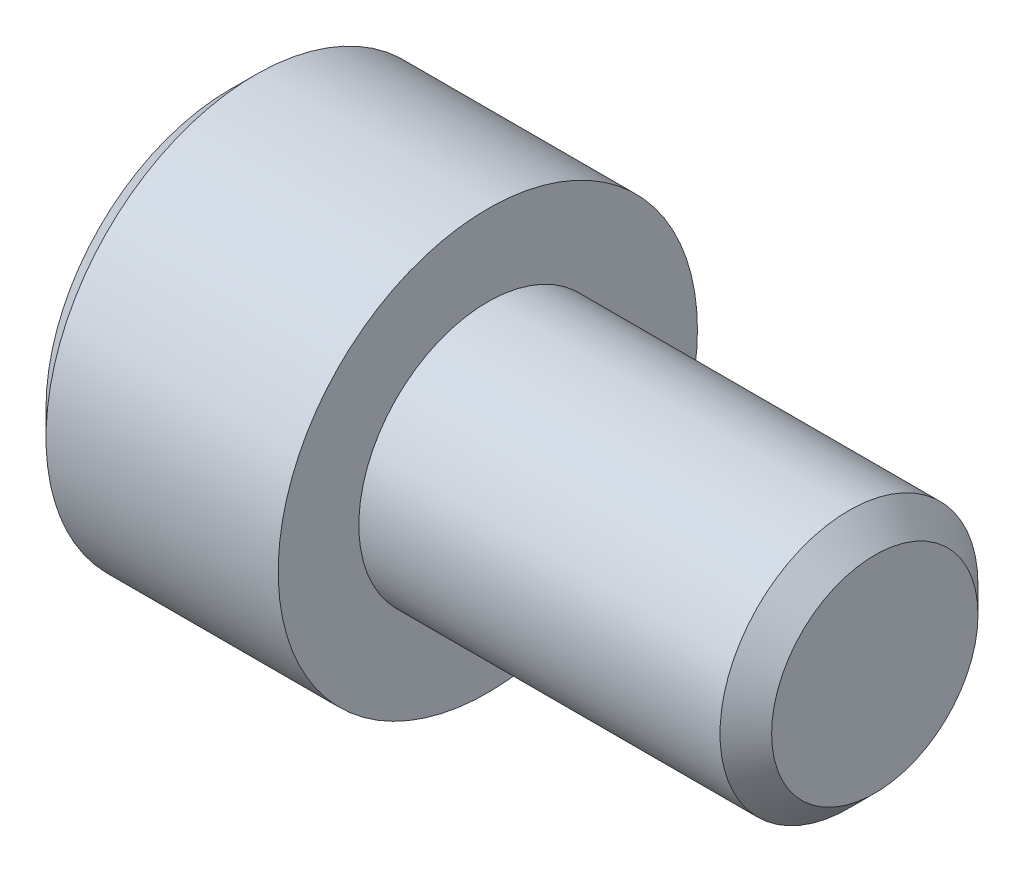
ISO-10303-21;
HEADER;
FILE_DESCRIPTION(('STEP AP214'),'2;1');
FILE_NAME('part.step','',(''),(''),'','','');
FILE_SCHEMA(('AUTOMOTIVE_DESIGN { 1 0 10303 214 1 1 1 1 }'));
ENDSEC;
DATA;
#1=APPLICATION_CONTEXT('core data for automotive mechanical design processes');
#2=APPLICATION_PROTOCOL_DEFINITION('international standard','automotive_design',2000,#1);
#3=PRODUCT_CONTEXT('',#1,'mechanical');
#4=PRODUCT('Part','Part','',(#3));
#5=PRODUCT_RELATED_PRODUCT_CATEGORY('part','',(#4));
#6=PRODUCT_DEFINITION_FORMATION('','',#4);
#7=PRODUCT_DEFINITION_CONTEXT('part definition',#1,'design');
#8=PRODUCT_DEFINITION('design','',#6,#7);
#9=PRODUCT_DEFINITION_SHAPE('','',#8);
#10=(LENGTH_UNIT() NAMED_UNIT(*) SI_UNIT(.MILLI.,.METRE.));
#11=(NAMED_UNIT(*) PLANE_ANGLE_UNIT() SI_UNIT($,.RADIAN.));
#12=(NAMED_UNIT(*) SI_UNIT($,.STERADIAN.) SOLID_ANGLE_UNIT());
#13=UNCERTAINTY_MEASURE_WITH_UNIT(LENGTH_MEASURE(1.E-05),#10,'distance_accuracy_value','');
#14=(GEOMETRIC_REPRESENTATION_CONTEXT(3) GLOBAL_UNCERTAINTY_ASSIGNED_CONTEXT((#13)) GLOBAL_UNIT_ASSIGNED_CONTEXT((#10,
#11,#12)) REPRESENTATION_CONTEXT('',''));
#15=CARTESIAN_POINT('',(0.,0.,0.));
#16=DIRECTION('',(0.,0.,1.));
#17=DIRECTION('',(1.,0.,0.));
#18=AXIS2_PLACEMENT_3D('',#15,#16,#17);
#19=CARTESIAN_POINT('',(0.,0.,0.));
#20=DIRECTION('',(-1.,0.,0.));
#21=DIRECTION('',(0.,0.,1.));
#22=AXIS2_PLACEMENT_3D('',#19,#20,#21);
#23=PLANE('',#22);
#24=CARTESIAN_POINT('',(0.,0.,0.));
#25=DIRECTION('',(1.,0.,0.));
#26=DIRECTION('',(0.,0.,-1.));
#27=AXIS2_PLACEMENT_3D('',#24,#25,#26);
#28=CIRCLE('',#27,5.7);
#29=CARTESIAN_POINT('',(0.,0.,-5.7));
#30=VERTEX_POINT('',#29);
#31=EDGE_CURVE('E10',#30,#30,#28,.T.);
#32=ORIENTED_EDGE('',*,*,#31,.F.);
#33=EDGE_LOOP('',(#32));
#34=FACE_BOUND('',#33,.T.);
#35=ADVANCED_FACE('F33',(#34),#23,.T.);
#36=CARTESIAN_POINT('',(0.799999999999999,0.,0.));
#37=DIRECTION('',(1.,0.,0.));
#38=DIRECTION('',(0.,0.,-1.));
#39=AXIS2_PLACEMENT_3D('',#36,#37,#38);
#40=CONICAL_SURFACE('',#39,6.5,0.785398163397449);
#41=ORIENTED_EDGE('',*,*,#31,.T.);
#42=EDGE_LOOP('',(#41));
#43=FACE_BOUND('',#42,.T.);
#44=CARTESIAN_POINT('',(0.799999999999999,0.,0.));
#45=DIRECTION('',(1.,0.,0.));
#46=DIRECTION('',(0.,0.,-1.));
#47=AXIS2_PLACEMENT_3D('',#44,#45,#46);
#48=CIRCLE('',#47,6.5);
#49=CARTESIAN_POINT('',(0.799999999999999,0.,-6.5));
#50=VERTEX_POINT('',#49);
#51=EDGE_CURVE('E39',#50,#50,#48,.T.);
#52=ORIENTED_EDGE('',*,*,#51,.F.);
#53=EDGE_LOOP('',(#52));
#54=FACE_BOUND('',#53,.T.);
#55=ADVANCED_FACE('F75',(#43,#54),#40,.T.);
#56=CARTESIAN_POINT('',(20.,0.,0.));
#57=DIRECTION('',(1.,0.,0.));
#58=DIRECTION('',(0.,0.,-1.));
#59=AXIS2_PLACEMENT_3D('',#56,#57,#58);
#60=CYLINDRICAL_SURFACE('',#59,6.5);
#61=ORIENTED_EDGE('',*,*,#51,.T.);
#62=EDGE_LOOP('',(#61));
#63=FACE_BOUND('',#62,.T.);
#64=CARTESIAN_POINT('',(8.,0.,0.));
#65=DIRECTION('',(1.,0.,0.));
#66=DIRECTION('',(0.,0.,-1.));
#67=AXIS2_PLACEMENT_3D('',#64,#65,#66);
#68=CIRCLE('',#67,6.5);
#69=CARTESIAN_POINT('',(8.,0.,-6.5));
#70=VERTEX_POINT('',#69);
#71=EDGE_CURVE('E43',#70,#70,#68,.T.);
#72=ORIENTED_EDGE('',*,*,#71,.F.);
#73=EDGE_LOOP('',(#72));
#74=FACE_BOUND('',#73,.T.);
#75=ADVANCED_FACE('F80',(#63,#74),#60,.T.);
#76=CARTESIAN_POINT('',(8.,6.5,0.));
#77=DIRECTION('',(1.,0.,0.));
#78=DIRECTION('',(0.,0.,-1.));
#79=AXIS2_PLACEMENT_3D('',#76,#77,#78);
#80=PLANE('',#79);
#81=ORIENTED_EDGE('',*,*,#71,.T.);
#82=EDGE_LOOP('',(#81));
#83=FACE_BOUND('',#82,.T.);
#84=CARTESIAN_POINT('',(8.,0.,0.));
#85=DIRECTION('',(1.,0.,0.));
#86=DIRECTION('',(0.,0.,-1.));
#87=AXIS2_PLACEMENT_3D('',#84,#85,#86);
#88=CIRCLE('',#87,4.);
#89=CARTESIAN_POINT('',(8.,0.,-4.));
#90=VERTEX_POINT('',#89);
#91=EDGE_CURVE('E47',#90,#90,#88,.T.);
#92=ORIENTED_EDGE('',*,*,#91,.F.);
#93=EDGE_LOOP('',(#92));
#94=FACE_BOUND('',#93,.T.);
#95=ADVANCED_FACE('F71',(#83,#94),#80,.T.);
#96=CARTESIAN_POINT('',(20.,0.,0.));
#97=DIRECTION('',(1.,0.,0.));
#98=DIRECTION('',(0.,0.,-1.));
#99=AXIS2_PLACEMENT_3D('',#96,#97,#98);
#100=CYLINDRICAL_SURFACE('',#99,4.);
#101=ORIENTED_EDGE('',*,*,#91,.T.);
#102=EDGE_LOOP('',(#101));
#103=FACE_BOUND('',#102,.T.);
#104=CARTESIAN_POINT('',(19.2,0.,0.));
#105=DIRECTION('',(1.,0.,0.));
#106=DIRECTION('',(0.,0.,-1.));
#107=AXIS2_PLACEMENT_3D('',#104,#105,#106);
#108=CIRCLE('',#107,4.);
#109=CARTESIAN_POINT('',(19.2,0.,-4.));
#110=VERTEX_POINT('',#109);
#111=EDGE_CURVE('E52',#110,#110,#108,.T.);
#112=ORIENTED_EDGE('',*,*,#111,.F.);
#113=EDGE_LOOP('',(#112));
#114=FACE_BOUND('',#113,.T.);
#115=ADVANCED_FACE('F63',(#103,#114),#100,.T.);
#116=CARTESIAN_POINT('',(20.,0.,0.));
#117=DIRECTION('',(-1.,0.,0.));
#118=DIRECTION('',(0.,0.,1.));
#119=AXIS2_PLACEMENT_3D('',#116,#117,#118);
#120=CONICAL_SURFACE('',#119,3.20000000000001,0.785398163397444);
#121=ORIENTED_EDGE('',*,*,#111,.T.);
#122=EDGE_LOOP('',(#121));
#123=FACE_BOUND('',#122,.T.);
#124=CARTESIAN_POINT('',(20.,0.,0.));
#125=DIRECTION('',(1.,0.,0.));
#126=DIRECTION('',(0.,0.,-1.));
#127=AXIS2_PLACEMENT_3D('',#124,#125,#126);
#128=CIRCLE('',#127,3.20000000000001);
#129=CARTESIAN_POINT('',(20.,0.,-3.20000000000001));
#130=VERTEX_POINT('',#129);
#131=EDGE_CURVE('E55',#130,#130,#128,.T.);
#132=ORIENTED_EDGE('',*,*,#131,.F.);
#133=EDGE_LOOP('',(#132));
#134=FACE_BOUND('',#133,.T.);
#135=ADVANCED_FACE('F61',(#123,#134),#120,.T.);
#136=CARTESIAN_POINT('',(20.,3.20000000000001,0.));
#137=DIRECTION('',(1.,0.,0.));
#138=DIRECTION('',(0.,0.,-1.));
#139=AXIS2_PLACEMENT_3D('',#136,#137,#138);
#140=PLANE('',#139);
#141=ORIENTED_EDGE('',*,*,#131,.T.);
#142=EDGE_LOOP('',(#141));
#143=FACE_BOUND('',#142,.T.);
#144=ADVANCED_FACE('F59',(#143),#140,.T.);
#145=CLOSED_SHELL('',(#35,#55,#75,#95,#115,#135,#144));
#146=MANIFOLD_SOLID_BREP('B2',#145);
#147=ADVANCED_BREP_SHAPE_REPRESENTATION('',(#18,#146),#14);
#148=SHAPE_DEFINITION_REPRESENTATION(#9,#147);
ENDSEC;
END-ISO-10303-21;
